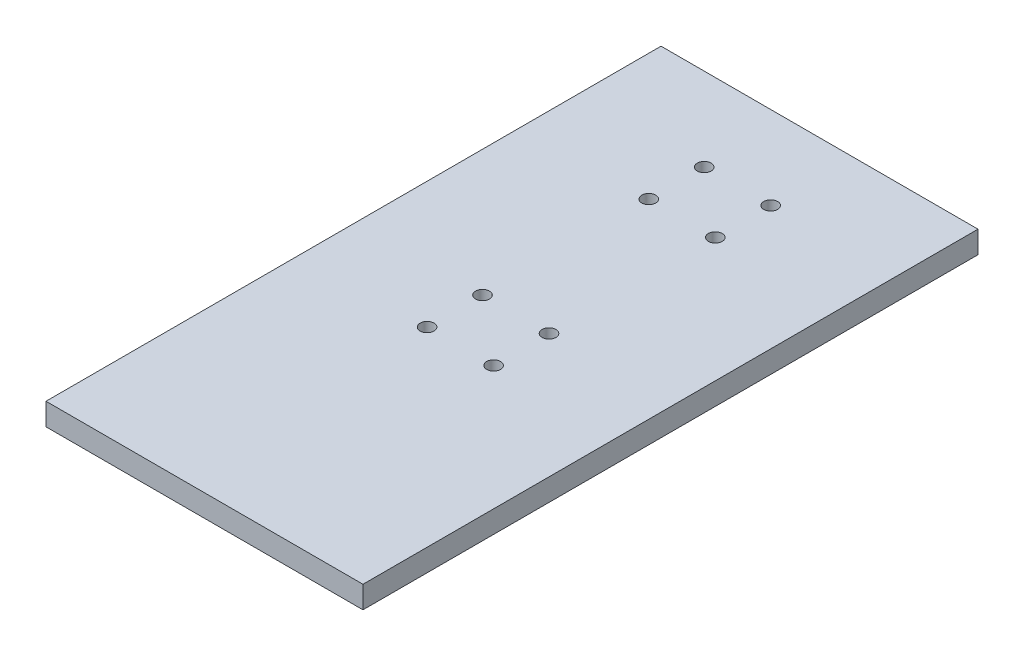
ISO-10303-21;
HEADER;
FILE_DESCRIPTION(('STEP AP214'),'2;1');
FILE_NAME('part.step','',(''),(''),'','','');
FILE_SCHEMA(('AUTOMOTIVE_DESIGN { 1 0 10303 214 1 1 1 1 }'));
ENDSEC;
DATA;
#1=APPLICATION_CONTEXT('core data for automotive mechanical design processes');
#2=APPLICATION_PROTOCOL_DEFINITION('international standard','automotive_design',2000,#1);
#3=PRODUCT_CONTEXT('',#1,'mechanical');
#4=PRODUCT('Part','Part','',(#3));
#5=PRODUCT_RELATED_PRODUCT_CATEGORY('part','',(#4));
#6=PRODUCT_DEFINITION_FORMATION('','',#4);
#7=PRODUCT_DEFINITION_CONTEXT('part definition',#1,'design');
#8=PRODUCT_DEFINITION('design','',#6,#7);
#9=PRODUCT_DEFINITION_SHAPE('','',#8);
#10=(LENGTH_UNIT() NAMED_UNIT(*) SI_UNIT(.MILLI.,.METRE.));
#11=(NAMED_UNIT(*) PLANE_ANGLE_UNIT() SI_UNIT($,.RADIAN.));
#12=(NAMED_UNIT(*) SI_UNIT($,.STERADIAN.) SOLID_ANGLE_UNIT());
#13=UNCERTAINTY_MEASURE_WITH_UNIT(LENGTH_MEASURE(1.E-05),#10,'distance_accuracy_value','');
#14=(GEOMETRIC_REPRESENTATION_CONTEXT(3) GLOBAL_UNCERTAINTY_ASSIGNED_CONTEXT((#13)) GLOBAL_UNIT_ASSIGNED_CONTEXT((#10,
#11,#12)) REPRESENTATION_CONTEXT('',''));
#15=CARTESIAN_POINT('',(0.,0.,0.));
#16=DIRECTION('',(0.,0.,1.));
#17=DIRECTION('',(1.,0.,0.));
#18=AXIS2_PLACEMENT_3D('',#15,#16,#17);
#19=CARTESIAN_POINT('',(360.7556,50.8,901.37465906));
#20=DIRECTION('',(-1.,0.,0.));
#21=DIRECTION('',(0.,0.,1.));
#22=AXIS2_PLACEMENT_3D('',#19,#20,#21);
#23=PLANE('',#22);
#24=DIRECTION('',(0.,0.,-1.));
#25=VECTOR('',#24,1.);
#26=CARTESIAN_POINT('',(360.7556,0.,901.37465906));
#27=LINE('',#26,#25);
#28=CARTESIAN_POINT('',(360.7556,0.,901.37465906));
#29=VERTEX_POINT('',#28);
#30=CARTESIAN_POINT('',(360.7556,0.,-508.00000001));
#31=VERTEX_POINT('',#30);
#32=EDGE_CURVE('E105',#29,#31,#27,.T.);
#33=ORIENTED_EDGE('',*,*,#32,.T.);
#34=DIRECTION('',(0.,-1.,0.));
#35=VECTOR('',#34,1.);
#36=CARTESIAN_POINT('',(360.7556,50.8,-508.00000001));
#37=LINE('',#36,#35);
#38=CARTESIAN_POINT('',(360.7556,50.8,-508.00000001));
#39=VERTEX_POINT('',#38);
#40=EDGE_CURVE('E11',#39,#31,#37,.T.);
#41=ORIENTED_EDGE('',*,*,#40,.F.);
#42=DIRECTION('',(0.,0.,-1.));
#43=VECTOR('',#42,1.);
#44=CARTESIAN_POINT('',(360.7556,50.8,901.37465906));
#45=LINE('',#44,#43);
#46=CARTESIAN_POINT('',(360.7556,50.8,901.37465906));
#47=VERTEX_POINT('',#46);
#48=EDGE_CURVE('E89',#47,#39,#45,.T.);
#49=ORIENTED_EDGE('',*,*,#48,.F.);
#50=DIRECTION('',(0.,-1.,0.));
#51=VECTOR('',#50,1.);
#52=CARTESIAN_POINT('',(360.7556,50.8,901.37465906));
#53=LINE('',#52,#51);
#54=EDGE_CURVE('E98',#47,#29,#53,.T.);
#55=ORIENTED_EDGE('',*,*,#54,.T.);
#56=EDGE_LOOP('',(#33,#41,#49,#55));
#57=FACE_BOUND('',#56,.T.);
#58=ADVANCED_FACE('F39',(#57),#23,.F.);
#59=CARTESIAN_POINT('',(360.7556,50.8,-508.00000001));
#60=DIRECTION('',(0.,0.,1.));
#61=DIRECTION('',(1.,0.,0.));
#62=AXIS2_PLACEMENT_3D('',#59,#60,#61);
#63=PLANE('',#62);
#64=DIRECTION('',(-1.,0.,0.));
#65=VECTOR('',#64,1.);
#66=CARTESIAN_POINT('',(360.7556,0.,-508.00000001));
#67=LINE('',#66,#65);
#68=CARTESIAN_POINT('',(-365.6084,0.,-508.00000001));
#69=VERTEX_POINT('',#68);
#70=EDGE_CURVE('E94',#31,#69,#67,.T.);
#71=ORIENTED_EDGE('',*,*,#70,.T.);
#72=DIRECTION('',(0.,-1.,0.));
#73=VECTOR('',#72,1.);
#74=CARTESIAN_POINT('',(-365.6084,50.8,-508.00000001));
#75=LINE('',#74,#73);
#76=CARTESIAN_POINT('',(-365.6084,50.8,-508.00000001));
#77=VERTEX_POINT('',#76);
#78=EDGE_CURVE('E50',#77,#69,#75,.T.);
#79=ORIENTED_EDGE('',*,*,#78,.F.);
#80=DIRECTION('',(-1.,0.,0.));
#81=VECTOR('',#80,1.);
#82=CARTESIAN_POINT('',(360.7556,50.8,-508.00000001));
#83=LINE('',#82,#81);
#84=EDGE_CURVE('E84',#39,#77,#83,.T.);
#85=ORIENTED_EDGE('',*,*,#84,.F.);
#86=ORIENTED_EDGE('',*,*,#40,.T.);
#87=EDGE_LOOP('',(#71,#79,#85,#86));
#88=FACE_BOUND('',#87,.T.);
#89=ADVANCED_FACE('F91',(#88),#63,.F.);
#90=CARTESIAN_POINT('',(-365.6084,50.8,901.37465906));
#91=DIRECTION('',(1.,0.,0.));
#92=DIRECTION('',(0.,0.,-1.));
#93=AXIS2_PLACEMENT_3D('',#90,#91,#92);
#94=PLANE('',#93);
#95=DIRECTION('',(0.,0.,1.));
#96=VECTOR('',#95,1.);
#97=CARTESIAN_POINT('',(-365.6084,0.,901.37465906));
#98=LINE('',#97,#96);
#99=CARTESIAN_POINT('',(-365.6084,0.,901.37465906));
#100=VERTEX_POINT('',#99);
#101=EDGE_CURVE('E75',#69,#100,#98,.T.);
#102=ORIENTED_EDGE('',*,*,#101,.T.);
#103=DIRECTION('',(0.,-1.,0.));
#104=VECTOR('',#103,1.);
#105=CARTESIAN_POINT('',(-365.6084,50.8,901.37465906));
#106=LINE('',#105,#104);
#107=CARTESIAN_POINT('',(-365.6084,50.8,901.37465906));
#108=VERTEX_POINT('',#107);
#109=EDGE_CURVE('E92',#108,#100,#106,.T.);
#110=ORIENTED_EDGE('',*,*,#109,.F.);
#111=DIRECTION('',(0.,0.,1.));
#112=VECTOR('',#111,1.);
#113=CARTESIAN_POINT('',(-365.6084,50.8,901.37465906));
#114=LINE('',#113,#112);
#115=EDGE_CURVE('E86',#77,#108,#114,.T.);
#116=ORIENTED_EDGE('',*,*,#115,.F.);
#117=ORIENTED_EDGE('',*,*,#78,.T.);
#118=EDGE_LOOP('',(#102,#110,#116,#117));
#119=FACE_BOUND('',#118,.T.);
#120=ADVANCED_FACE('F96',(#119),#94,.F.);
#121=CARTESIAN_POINT('',(360.7556,50.8,901.37465906));
#122=DIRECTION('',(0.,0.,-1.));
#123=DIRECTION('',(-1.,0.,0.));
#124=AXIS2_PLACEMENT_3D('',#121,#122,#123);
#125=PLANE('',#124);
#126=DIRECTION('',(1.,0.,0.));
#127=VECTOR('',#126,1.);
#128=CARTESIAN_POINT('',(360.7556,0.,901.37465906));
#129=LINE('',#128,#127);
#130=EDGE_CURVE('E80',#100,#29,#129,.T.);
#131=ORIENTED_EDGE('',*,*,#130,.T.);
#132=ORIENTED_EDGE('',*,*,#54,.F.);
#133=DIRECTION('',(1.,0.,0.));
#134=VECTOR('',#133,1.);
#135=CARTESIAN_POINT('',(360.7556,50.8,901.37465906));
#136=LINE('',#135,#134);
#137=EDGE_CURVE('E54',#108,#47,#136,.T.);
#138=ORIENTED_EDGE('',*,*,#137,.F.);
#139=ORIENTED_EDGE('',*,*,#109,.T.);
#140=EDGE_LOOP('',(#131,#132,#138,#139));
#141=FACE_BOUND('',#140,.T.);
#142=ADVANCED_FACE('F109',(#141),#125,.F.);
#143=CARTESIAN_POINT('',(0.,50.8,0.));
#144=DIRECTION('',(0.,1.,0.));
#145=DIRECTION('',(0.,0.,1.));
#146=AXIS2_PLACEMENT_3D('',#143,#144,#145);
#147=PLANE('',#146);
#148=CARTESIAN_POINT('',(-76.2000000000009,50.8,317.499999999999));
#149=DIRECTION('',(0.,1.,0.));
#150=DIRECTION('',(0.,0.,1.));
#151=AXIS2_PLACEMENT_3D('',#148,#149,#150);
#152=CIRCLE('',#151,15.8749999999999);
#153=CARTESIAN_POINT('',(-76.2000000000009,50.8,333.374999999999));
#154=VERTEX_POINT('',#153);
#155=EDGE_CURVE('E143',#154,#154,#152,.T.);
#156=ORIENTED_EDGE('',*,*,#155,.F.);
#157=EDGE_LOOP('',(#156));
#158=FACE_BOUND('',#157,.T.);
#159=CARTESIAN_POINT('',(-76.2000000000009,50.8,-317.500000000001));
#160=DIRECTION('',(0.,1.,0.));
#161=DIRECTION('',(0.,0.,1.));
#162=AXIS2_PLACEMENT_3D('',#159,#160,#161);
#163=CIRCLE('',#162,15.875);
#164=CARTESIAN_POINT('',(-76.2000000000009,50.8,-301.625000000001));
#165=VERTEX_POINT('',#164);
#166=EDGE_CURVE('E133',#165,#165,#163,.T.);
#167=ORIENTED_EDGE('',*,*,#166,.F.);
#168=EDGE_LOOP('',(#167));
#169=FACE_BOUND('',#168,.T.);
#170=CARTESIAN_POINT('',(76.2000000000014,50.8,-317.500000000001));
#171=DIRECTION('',(0.,1.,0.));
#172=DIRECTION('',(0.,0.,1.));
#173=AXIS2_PLACEMENT_3D('',#170,#171,#172);
#174=CIRCLE('',#173,15.875);
#175=CARTESIAN_POINT('',(76.2000000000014,50.8,-301.625000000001));
#176=VERTEX_POINT('',#175);
#177=EDGE_CURVE('E129',#176,#176,#174,.T.);
#178=ORIENTED_EDGE('',*,*,#177,.F.);
#179=EDGE_LOOP('',(#178));
#180=FACE_BOUND('',#179,.T.);
#181=CARTESIAN_POINT('',(76.2,50.8,190.499999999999));
#182=DIRECTION('',(0.,1.,0.));
#183=DIRECTION('',(0.,0.,1.));
#184=AXIS2_PLACEMENT_3D('',#181,#182,#183);
#185=CIRCLE('',#184,15.875);
#186=CARTESIAN_POINT('',(76.2,50.8,206.374999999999));
#187=VERTEX_POINT('',#186);
#188=EDGE_CURVE('E125',#187,#187,#185,.T.);
#189=ORIENTED_EDGE('',*,*,#188,.F.);
#190=EDGE_LOOP('',(#189));
#191=FACE_BOUND('',#190,.T.);
#192=CARTESIAN_POINT('',(-76.2000000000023,50.8,190.499999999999));
#193=DIRECTION('',(0.,1.,0.));
#194=DIRECTION('',(0.,0.,1.));
#195=AXIS2_PLACEMENT_3D('',#192,#193,#194);
#196=CIRCLE('',#195,15.8749999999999);
#197=CARTESIAN_POINT('',(-76.2000000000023,50.8,206.374999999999));
#198=VERTEX_POINT('',#197);
#199=EDGE_CURVE('E158',#198,#198,#196,.T.);
#200=ORIENTED_EDGE('',*,*,#199,.F.);
#201=EDGE_LOOP('',(#200));
#202=FACE_BOUND('',#201,.T.);
#203=CARTESIAN_POINT('',(-76.2000000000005,50.8,-190.500000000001));
#204=DIRECTION('',(0.,1.,0.));
#205=DIRECTION('',(0.,0.,1.));
#206=AXIS2_PLACEMENT_3D('',#203,#204,#205);
#207=CIRCLE('',#206,15.875);
#208=CARTESIAN_POINT('',(-76.2000000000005,50.8,-174.625000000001));
#209=VERTEX_POINT('',#208);
#210=EDGE_CURVE('E155',#209,#209,#207,.T.);
#211=ORIENTED_EDGE('',*,*,#210,.F.);
#212=EDGE_LOOP('',(#211));
#213=FACE_BOUND('',#212,.T.);
#214=CARTESIAN_POINT('',(76.2000000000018,50.8,-190.500000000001));
#215=DIRECTION('',(0.,1.,0.));
#216=DIRECTION('',(0.,0.,1.));
#217=AXIS2_PLACEMENT_3D('',#214,#215,#216);
#218=CIRCLE('',#217,15.8750000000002);
#219=CARTESIAN_POINT('',(76.2000000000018,50.8,-174.625));
#220=VERTEX_POINT('',#219);
#221=EDGE_CURVE('E148',#220,#220,#218,.T.);
#222=ORIENTED_EDGE('',*,*,#221,.F.);
#223=EDGE_LOOP('',(#222));
#224=FACE_BOUND('',#223,.T.);
#225=CARTESIAN_POINT('',(76.2000000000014,50.8,317.499999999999));
#226=DIRECTION('',(0.,1.,0.));
#227=DIRECTION('',(0.,0.,1.));
#228=AXIS2_PLACEMENT_3D('',#225,#226,#227);
#229=CIRCLE('',#228,15.8749999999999);
#230=CARTESIAN_POINT('',(76.2000000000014,50.8,333.374999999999));
#231=VERTEX_POINT('',#230);
#232=EDGE_CURVE('E104',#231,#231,#229,.T.);
#233=ORIENTED_EDGE('',*,*,#232,.F.);
#234=EDGE_LOOP('',(#233));
#235=FACE_BOUND('',#234,.T.);
#236=ORIENTED_EDGE('',*,*,#48,.T.);
#237=ORIENTED_EDGE('',*,*,#84,.T.);
#238=ORIENTED_EDGE('',*,*,#115,.T.);
#239=ORIENTED_EDGE('',*,*,#137,.T.);
#240=EDGE_LOOP('',(#236,#237,#238,#239));
#241=FACE_BOUND('',#240,.T.);
#242=ADVANCED_FACE('F88',(#158,#169,#180,#191,#202,#213,#224,#235,#241),#147,.T.);
#243=CARTESIAN_POINT('',(0.,0.,0.));
#244=DIRECTION('',(0.,1.,0.));
#245=DIRECTION('',(0.,0.,1.));
#246=AXIS2_PLACEMENT_3D('',#243,#244,#245);
#247=PLANE('',#246);
#248=CARTESIAN_POINT('',(-76.2000000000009,0.,317.499999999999));
#249=DIRECTION('',(0.,1.,0.));
#250=DIRECTION('',(0.,0.,1.));
#251=AXIS2_PLACEMENT_3D('',#248,#249,#250);
#252=CIRCLE('',#251,15.8749999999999);
#253=CARTESIAN_POINT('',(-76.2000000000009,0.,333.374999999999));
#254=VERTEX_POINT('',#253);
#255=EDGE_CURVE('E116',#254,#254,#252,.T.);
#256=ORIENTED_EDGE('',*,*,#255,.T.);
#257=EDGE_LOOP('',(#256));
#258=FACE_BOUND('',#257,.T.);
#259=CARTESIAN_POINT('',(-76.2000000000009,0.,-317.500000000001));
#260=DIRECTION('',(0.,1.,0.));
#261=DIRECTION('',(0.,0.,1.));
#262=AXIS2_PLACEMENT_3D('',#259,#260,#261);
#263=CIRCLE('',#262,15.875);
#264=CARTESIAN_POINT('',(-76.2000000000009,0.,-301.625000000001));
#265=VERTEX_POINT('',#264);
#266=EDGE_CURVE('E137',#265,#265,#263,.T.);
#267=ORIENTED_EDGE('',*,*,#266,.T.);
#268=EDGE_LOOP('',(#267));
#269=FACE_BOUND('',#268,.T.);
#270=CARTESIAN_POINT('',(76.2000000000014,0.,-317.500000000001));
#271=DIRECTION('',(0.,1.,0.));
#272=DIRECTION('',(0.,0.,1.));
#273=AXIS2_PLACEMENT_3D('',#270,#271,#272);
#274=CIRCLE('',#273,15.875);
#275=CARTESIAN_POINT('',(76.2000000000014,0.,-301.625000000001));
#276=VERTEX_POINT('',#275);
#277=EDGE_CURVE('E134',#276,#276,#274,.T.);
#278=ORIENTED_EDGE('',*,*,#277,.T.);
#279=EDGE_LOOP('',(#278));
#280=FACE_BOUND('',#279,.T.);
#281=CARTESIAN_POINT('',(76.2,0.,190.499999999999));
#282=DIRECTION('',(0.,1.,0.));
#283=DIRECTION('',(0.,0.,1.));
#284=AXIS2_PLACEMENT_3D('',#281,#282,#283);
#285=CIRCLE('',#284,15.875);
#286=CARTESIAN_POINT('',(76.2,0.,206.374999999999));
#287=VERTEX_POINT('',#286);
#288=EDGE_CURVE('E124',#287,#287,#285,.T.);
#289=ORIENTED_EDGE('',*,*,#288,.T.);
#290=EDGE_LOOP('',(#289));
#291=FACE_BOUND('',#290,.T.);
#292=CARTESIAN_POINT('',(-76.2000000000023,0.,190.499999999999));
#293=DIRECTION('',(0.,1.,0.));
#294=DIRECTION('',(0.,0.,1.));
#295=AXIS2_PLACEMENT_3D('',#292,#293,#294);
#296=CIRCLE('',#295,15.8749999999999);
#297=CARTESIAN_POINT('',(-76.2000000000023,0.,206.374999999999));
#298=VERTEX_POINT('',#297);
#299=EDGE_CURVE('E127',#298,#298,#296,.T.);
#300=ORIENTED_EDGE('',*,*,#299,.T.);
#301=EDGE_LOOP('',(#300));
#302=FACE_BOUND('',#301,.T.);
#303=CARTESIAN_POINT('',(-76.2000000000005,0.,-190.500000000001));
#304=DIRECTION('',(0.,1.,0.));
#305=DIRECTION('',(0.,0.,1.));
#306=AXIS2_PLACEMENT_3D('',#303,#304,#305);
#307=CIRCLE('',#306,15.875);
#308=CARTESIAN_POINT('',(-76.2000000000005,0.,-174.625000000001));
#309=VERTEX_POINT('',#308);
#310=EDGE_CURVE('E154',#309,#309,#307,.T.);
#311=ORIENTED_EDGE('',*,*,#310,.T.);
#312=EDGE_LOOP('',(#311));
#313=FACE_BOUND('',#312,.T.);
#314=CARTESIAN_POINT('',(76.2000000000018,0.,-190.500000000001));
#315=DIRECTION('',(0.,1.,0.));
#316=DIRECTION('',(0.,0.,1.));
#317=AXIS2_PLACEMENT_3D('',#314,#315,#316);
#318=CIRCLE('',#317,15.8750000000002);
#319=CARTESIAN_POINT('',(76.2000000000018,0.,-174.625));
#320=VERTEX_POINT('',#319);
#321=EDGE_CURVE('E149',#320,#320,#318,.T.);
#322=ORIENTED_EDGE('',*,*,#321,.T.);
#323=EDGE_LOOP('',(#322));
#324=FACE_BOUND('',#323,.T.);
#325=CARTESIAN_POINT('',(76.2000000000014,0.,317.499999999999));
#326=DIRECTION('',(0.,1.,0.));
#327=DIRECTION('',(0.,0.,1.));
#328=AXIS2_PLACEMENT_3D('',#325,#326,#327);
#329=CIRCLE('',#328,15.8749999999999);
#330=CARTESIAN_POINT('',(76.2000000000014,0.,333.374999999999));
#331=VERTEX_POINT('',#330);
#332=EDGE_CURVE('E117',#331,#331,#329,.T.);
#333=ORIENTED_EDGE('',*,*,#332,.T.);
#334=EDGE_LOOP('',(#333));
#335=FACE_BOUND('',#334,.T.);
#336=ORIENTED_EDGE('',*,*,#32,.F.);
#337=ORIENTED_EDGE('',*,*,#130,.F.);
#338=ORIENTED_EDGE('',*,*,#101,.F.);
#339=ORIENTED_EDGE('',*,*,#70,.F.);
#340=EDGE_LOOP('',(#336,#337,#338,#339));
#341=FACE_BOUND('',#340,.T.);
#342=ADVANCED_FACE('F114',(#258,#269,#280,#291,#302,#313,#324,#335,#341),#247,.F.);
#343=CARTESIAN_POINT('',(76.2000000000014,50.8,317.499999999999));
#344=DIRECTION('',(0.,-1.,0.));
#345=DIRECTION('',(0.,0.,-1.));
#346=AXIS2_PLACEMENT_3D('',#343,#344,#345);
#347=CYLINDRICAL_SURFACE('',#346,15.8749999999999);
#348=ORIENTED_EDGE('',*,*,#232,.T.);
#349=EDGE_LOOP('',(#348));
#350=FACE_BOUND('',#349,.T.);
#351=ORIENTED_EDGE('',*,*,#332,.F.);
#352=EDGE_LOOP('',(#351));
#353=FACE_BOUND('',#352,.T.);
#354=ADVANCED_FACE('F194',(#350,#353),#347,.F.);
#355=CARTESIAN_POINT('',(76.2000000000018,50.8,-190.500000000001));
#356=DIRECTION('',(0.,-1.,0.));
#357=DIRECTION('',(0.,0.,-1.));
#358=AXIS2_PLACEMENT_3D('',#355,#356,#357);
#359=CYLINDRICAL_SURFACE('',#358,15.8750000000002);
#360=ORIENTED_EDGE('',*,*,#221,.T.);
#361=EDGE_LOOP('',(#360));
#362=FACE_BOUND('',#361,.T.);
#363=ORIENTED_EDGE('',*,*,#321,.F.);
#364=EDGE_LOOP('',(#363));
#365=FACE_BOUND('',#364,.T.);
#366=ADVANCED_FACE('F178',(#362,#365),#359,.F.);
#367=CARTESIAN_POINT('',(-76.2000000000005,50.8,-190.500000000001));
#368=DIRECTION('',(0.,-1.,0.));
#369=DIRECTION('',(0.,0.,-1.));
#370=AXIS2_PLACEMENT_3D('',#367,#368,#369);
#371=CYLINDRICAL_SURFACE('',#370,15.875);
#372=ORIENTED_EDGE('',*,*,#210,.T.);
#373=EDGE_LOOP('',(#372));
#374=FACE_BOUND('',#373,.T.);
#375=ORIENTED_EDGE('',*,*,#310,.F.);
#376=EDGE_LOOP('',(#375));
#377=FACE_BOUND('',#376,.T.);
#378=ADVANCED_FACE('F166',(#374,#377),#371,.F.);
#379=CARTESIAN_POINT('',(-76.2000000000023,50.8,190.499999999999));
#380=DIRECTION('',(0.,-1.,0.));
#381=DIRECTION('',(0.,0.,-1.));
#382=AXIS2_PLACEMENT_3D('',#379,#380,#381);
#383=CYLINDRICAL_SURFACE('',#382,15.8749999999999);
#384=ORIENTED_EDGE('',*,*,#199,.T.);
#385=EDGE_LOOP('',(#384));
#386=FACE_BOUND('',#385,.T.);
#387=ORIENTED_EDGE('',*,*,#299,.F.);
#388=EDGE_LOOP('',(#387));
#389=FACE_BOUND('',#388,.T.);
#390=ADVANCED_FACE('F167',(#386,#389),#383,.F.);
#391=CARTESIAN_POINT('',(76.2,50.8,190.499999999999));
#392=DIRECTION('',(0.,-1.,0.));
#393=DIRECTION('',(0.,0.,-1.));
#394=AXIS2_PLACEMENT_3D('',#391,#392,#393);
#395=CYLINDRICAL_SURFACE('',#394,15.875);
#396=ORIENTED_EDGE('',*,*,#188,.T.);
#397=EDGE_LOOP('',(#396));
#398=FACE_BOUND('',#397,.T.);
#399=ORIENTED_EDGE('',*,*,#288,.F.);
#400=EDGE_LOOP('',(#399));
#401=FACE_BOUND('',#400,.T.);
#402=ADVANCED_FACE('F169',(#398,#401),#395,.F.);
#403=CARTESIAN_POINT('',(76.2000000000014,50.8,-317.500000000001));
#404=DIRECTION('',(0.,-1.,0.));
#405=DIRECTION('',(0.,0.,-1.));
#406=AXIS2_PLACEMENT_3D('',#403,#404,#405);
#407=CYLINDRICAL_SURFACE('',#406,15.875);
#408=ORIENTED_EDGE('',*,*,#177,.T.);
#409=EDGE_LOOP('',(#408));
#410=FACE_BOUND('',#409,.T.);
#411=ORIENTED_EDGE('',*,*,#277,.F.);
#412=EDGE_LOOP('',(#411));
#413=FACE_BOUND('',#412,.T.);
#414=ADVANCED_FACE('F176',(#410,#413),#407,.F.);
#415=CARTESIAN_POINT('',(-76.2000000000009,50.8,-317.500000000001));
#416=DIRECTION('',(0.,-1.,0.));
#417=DIRECTION('',(0.,0.,-1.));
#418=AXIS2_PLACEMENT_3D('',#415,#416,#417);
#419=CYLINDRICAL_SURFACE('',#418,15.875);
#420=ORIENTED_EDGE('',*,*,#166,.T.);
#421=EDGE_LOOP('',(#420));
#422=FACE_BOUND('',#421,.T.);
#423=ORIENTED_EDGE('',*,*,#266,.F.);
#424=EDGE_LOOP('',(#423));
#425=FACE_BOUND('',#424,.T.);
#426=ADVANCED_FACE('F202',(#422,#425),#419,.F.);
#427=CARTESIAN_POINT('',(-76.2000000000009,50.8,317.499999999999));
#428=DIRECTION('',(0.,-1.,0.));
#429=DIRECTION('',(0.,0.,-1.));
#430=AXIS2_PLACEMENT_3D('',#427,#428,#429);
#431=CYLINDRICAL_SURFACE('',#430,15.8749999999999);
#432=ORIENTED_EDGE('',*,*,#155,.T.);
#433=EDGE_LOOP('',(#432));
#434=FACE_BOUND('',#433,.T.);
#435=ORIENTED_EDGE('',*,*,#255,.F.);
#436=EDGE_LOOP('',(#435));
#437=FACE_BOUND('',#436,.T.);
#438=ADVANCED_FACE('F207',(#434,#437),#431,.F.);
#439=CLOSED_SHELL('',(#58,#89,#120,#142,#242,#342,#354,#366,#378,#390,#402,#414,#426,#438));
#440=MANIFOLD_SOLID_BREP('B2',#439);
#441=ADVANCED_BREP_SHAPE_REPRESENTATION('',(#18,#440),#14);
#442=SHAPE_DEFINITION_REPRESENTATION(#9,#441);
ENDSEC;
END-ISO-10303-21;
